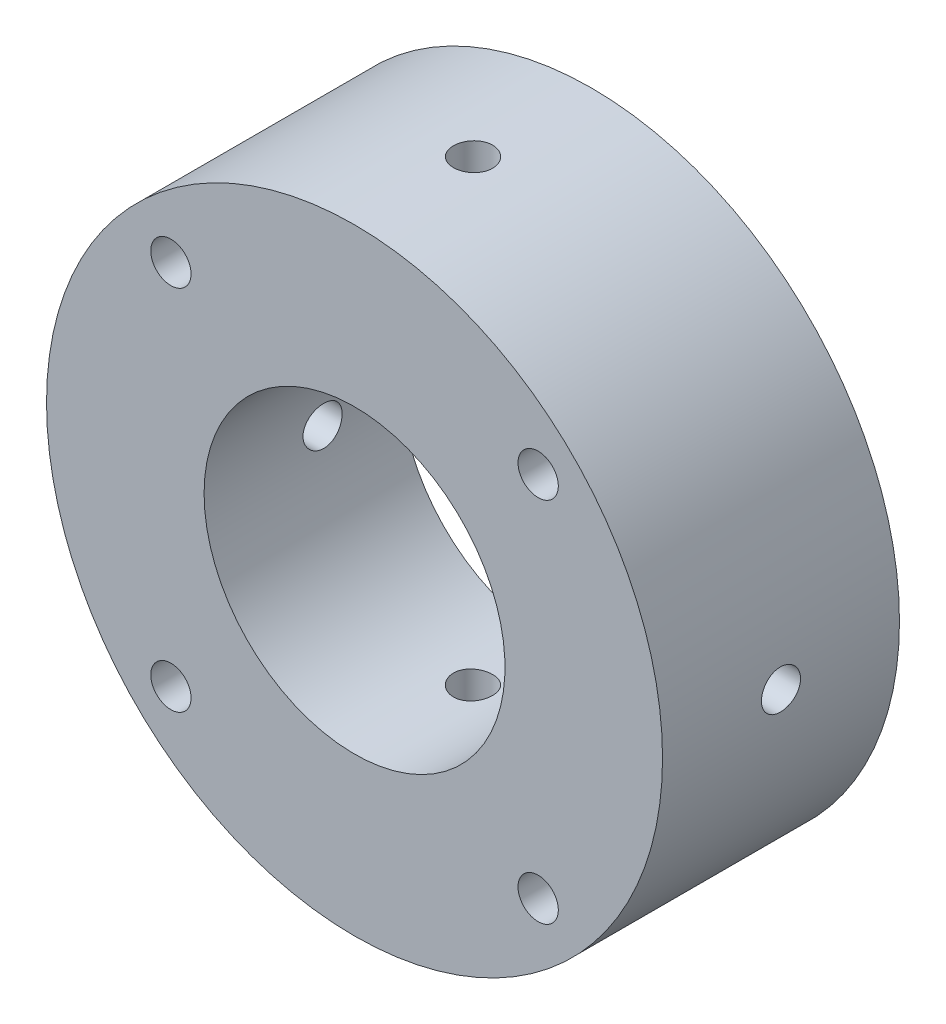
from build123d import *

# Parameters (mm, degrees)
SKETCH1_W                                           = 26
SKETCH1_H                                           = 20
F_2_CLEARANCE_HOLE1_D                               = 2.5
F_2_CLEARANCE_HOLE1_DEPTH                           = 6
HOLE1_D                                             = 25.4
HOLE1_CBORE_D                                       = 40
HOLE1_CBORE_DEPTH                                   = 3.4
F_4_CLEARANCE_HOLE1_D                               = 3.3
F_4_CLEARANCE_HOLE1_DEPTH                           = 65.407641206
F_4_CLEARANCE_HOLE2_D                               = 3.3
F_4_CLEARANCE_HOLE2_DEPTH                           = 13.407641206
F_4_CLEARANCE_HOLE3_D                               = 3.3
CBORE_FOR_4_BINDING_HEAD_MACHINE_SCREW1_D           = 3.4
CBORE_FOR_4_BINDING_HEAD_MACHINE_SCREW1_CBORE_D     = 6.5
CBORE_FOR_4_BINDING_HEAD_MACHINE_SCREW1_CBORE_DEPTH = 7.5


with BuildPart() as part:
    # Sketch1 → Revolve1 (revolve)
    with BuildSketch(Plane.XZ, mode=Mode.PRIVATE) as revolve1_sk:
        with Locations((13, 10)):
            Rectangle(SKETCH1_W, SKETCH1_H)
    revolve(revolve1_sk.sketch.rotate(Axis((0, 0, 20), (0, 0, -1)), 180), axis=Axis((0, 0, 20), (0, 0, -1)))

    # 2 Clearance Hole1
    with Locations(Plane(origin=(0, 0, 0), x_dir=(-1, 0, 0), z_dir=(0, 0, -1))):
        with Locations((-22.776165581, 3.200981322)):
            Hole(F_2_CLEARANCE_HOLE1_D / 2, depth=F_2_CLEARANCE_HOLE1_DEPTH)

    # Hole1 (through all)
    with Locations(Plane(origin=(0, 0, 0), x_dir=(-1, 0, 0), z_dir=(0, 0, -1))):
        with Locations((0, 0)):
            CounterBoreHole(HOLE1_D / 2, HOLE1_CBORE_D / 2, HOLE1_CBORE_DEPTH)

    # 4 Clearance Hole1
    with Locations(Plane(origin=(26, 0, 10), x_dir=(0, 1, 0), z_dir=(1, 0, 0))):
        with Locations((0, 0)):
            Hole(F_4_CLEARANCE_HOLE1_D / 2, depth=F_4_CLEARANCE_HOLE1_DEPTH)

    # 4 Clearance Hole2
    with Locations(Plane(origin=(0, 12.592358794, 0), x_dir=(-1, 0, 0), z_dir=(0, -1, 0))):
        with Locations((0, -10)):
            Hole(F_4_CLEARANCE_HOLE2_D / 2, depth=F_4_CLEARANCE_HOLE2_DEPTH)

    # 4 Clearance Hole3 (through all)
    with Locations(Plane(origin=(0, -12.592358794, 0), x_dir=(1, 0, 0), z_dir=(0, 1, 0))):
        with Locations((0, -10)):
            Hole(F_4_CLEARANCE_HOLE3_D / 2)

    # CBORE for _4 Binding Head Machine Screw1 (through all)
    with Locations(Plane(origin=(0, 0, 0), x_dir=(-1, 0, 0), z_dir=(0, 0, -1))):
        with Locations((-15.5, -15.5), (15.5, -15.5), (15.5, 15.5), (-15.5, 15.5)):
            CounterBoreHole(CBORE_FOR_4_BINDING_HEAD_MACHINE_SCREW1_D / 2, CBORE_FOR_4_BINDING_HEAD_MACHINE_SCREW1_CBORE_D / 2, CBORE_FOR_4_BINDING_HEAD_MACHINE_SCREW1_CBORE_DEPTH)


solid = part.part
